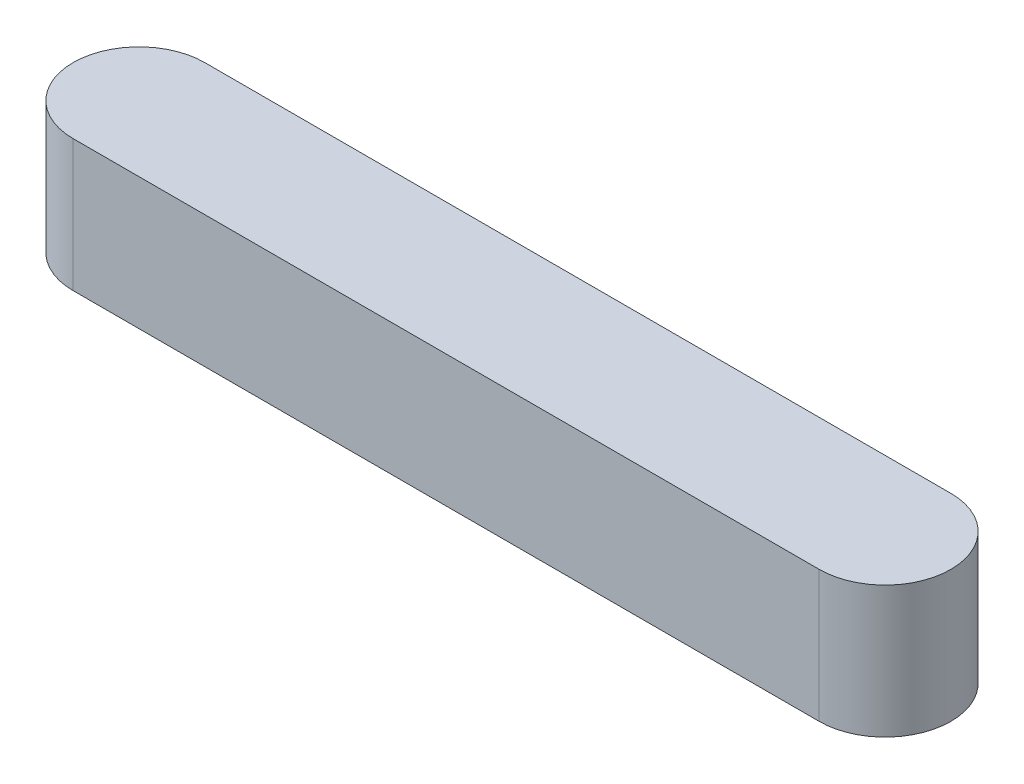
from build123d import *

# Parameters (mm, degrees)
BASE_EXTRUSION_DEPTH = 6


with BuildPart() as part:
    # Esquisse1 → Base-Extrusion (new body)
    with BuildSketch(Plane(origin=(0, 0, 0), x_dir=(0, 0, -1), z_dir=(0, -1, 0))):
        with BuildLine():
            Line((3, 0), (3, -34))
            ThreePointArc((3, -34), (0, -37), (-3, -34))
            Line((-3, -34), (-3, 0))
            ThreePointArc((-3, 0), (0, 3), (3, 0))
        make_face()
    extrude(amount=BASE_EXTRUSION_DEPTH)


solid = part.part
